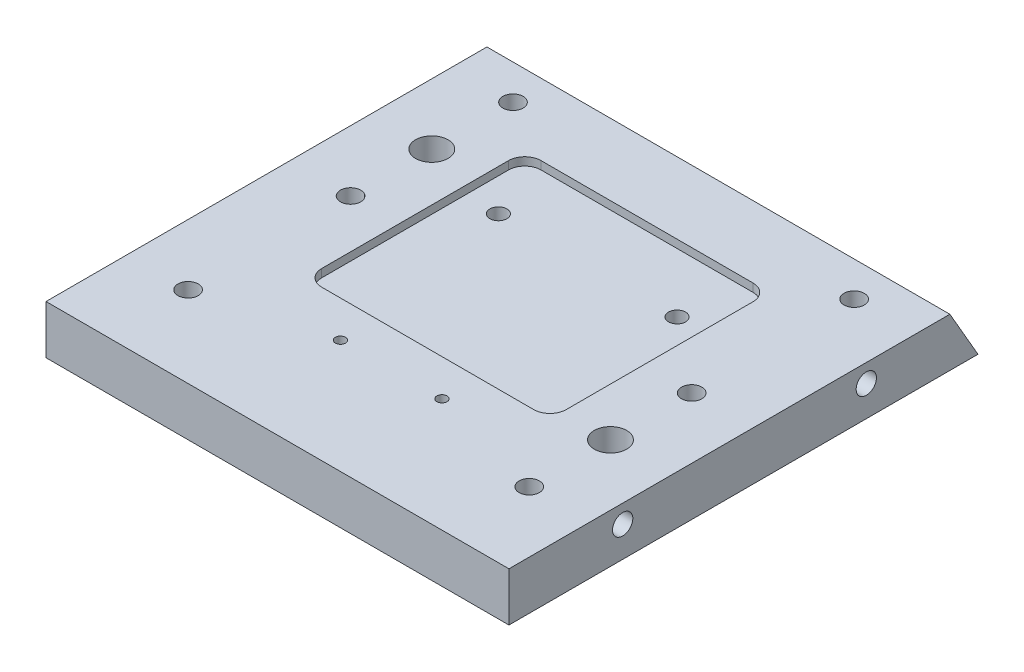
ISO-10303-21;
HEADER;
FILE_DESCRIPTION(('STEP AP214'),'2;1');
FILE_NAME('part.step','',(''),(''),'','','');
FILE_SCHEMA(('AUTOMOTIVE_DESIGN { 1 0 10303 214 1 1 1 1 }'));
ENDSEC;
DATA;
#1=APPLICATION_CONTEXT('core data for automotive mechanical design processes');
#2=APPLICATION_PROTOCOL_DEFINITION('international standard','automotive_design',2000,#1);
#3=PRODUCT_CONTEXT('',#1,'mechanical');
#4=PRODUCT('Part','Part','',(#3));
#5=PRODUCT_RELATED_PRODUCT_CATEGORY('part','',(#4));
#6=PRODUCT_DEFINITION_FORMATION('','',#4);
#7=PRODUCT_DEFINITION_CONTEXT('part definition',#1,'design');
#8=PRODUCT_DEFINITION('design','',#6,#7);
#9=PRODUCT_DEFINITION_SHAPE('','',#8);
#10=(LENGTH_UNIT() NAMED_UNIT(*) SI_UNIT(.MILLI.,.METRE.));
#11=(NAMED_UNIT(*) PLANE_ANGLE_UNIT() SI_UNIT($,.RADIAN.));
#12=(NAMED_UNIT(*) SI_UNIT($,.STERADIAN.) SOLID_ANGLE_UNIT());
#13=UNCERTAINTY_MEASURE_WITH_UNIT(LENGTH_MEASURE(1.E-05),#10,'distance_accuracy_value','');
#14=(GEOMETRIC_REPRESENTATION_CONTEXT(3) GLOBAL_UNCERTAINTY_ASSIGNED_CONTEXT((#13)) GLOBAL_UNIT_ASSIGNED_CONTEXT((#10,
#11,#12)) REPRESENTATION_CONTEXT('',''));
#15=CARTESIAN_POINT('',(0.,0.,0.));
#16=DIRECTION('',(0.,0.,1.));
#17=DIRECTION('',(1.,0.,0.));
#18=AXIS2_PLACEMENT_3D('',#15,#16,#17);
#19=CARTESIAN_POINT('',(57.,12.,0.));
#20=DIRECTION('',(0.,0.,-1.));
#21=DIRECTION('',(0.,1.,0.));
#22=AXIS2_PLACEMENT_3D('',#19,#20,#21);
#23=PLANE('',#22);
#24=DIRECTION('',(0.,-1.,0.));
#25=VECTOR('',#24,1.);
#26=CARTESIAN_POINT('',(-57.,12.,0.));
#27=LINE('',#26,#25);
#28=CARTESIAN_POINT('',(-57.,12.,0.));
#29=VERTEX_POINT('',#28);
#30=CARTESIAN_POINT('',(-57.,0.,0.));
#31=VERTEX_POINT('',#30);
#32=EDGE_CURVE('E269',#29,#31,#27,.T.);
#33=ORIENTED_EDGE('',*,*,#32,.T.);
#34=DIRECTION('',(-1.,0.,0.));
#35=VECTOR('',#34,1.);
#36=CARTESIAN_POINT('',(57.,0.,0.));
#37=LINE('',#36,#35);
#38=CARTESIAN_POINT('',(57.,0.,0.));
#39=VERTEX_POINT('',#38);
#40=EDGE_CURVE('E296',#39,#31,#37,.T.);
#41=ORIENTED_EDGE('',*,*,#40,.F.);
#42=DIRECTION('',(0.,-1.,0.));
#43=VECTOR('',#42,1.);
#44=CARTESIAN_POINT('',(57.,12.,0.));
#45=LINE('',#44,#43);
#46=CARTESIAN_POINT('',(57.,12.,0.));
#47=VERTEX_POINT('',#46);
#48=EDGE_CURVE('E270',#47,#39,#45,.T.);
#49=ORIENTED_EDGE('',*,*,#48,.F.);
#50=DIRECTION('',(-1.,0.,0.));
#51=VECTOR('',#50,1.);
#52=CARTESIAN_POINT('',(57.,12.,0.));
#53=LINE('',#52,#51);
#54=EDGE_CURVE('E280',#47,#29,#53,.T.);
#55=ORIENTED_EDGE('',*,*,#54,.T.);
#56=EDGE_LOOP('',(#33,#41,#49,#55));
#57=FACE_BOUND('',#56,.T.);
#58=ADVANCED_FACE('F37',(#57),#23,.F.);
#59=CARTESIAN_POINT('',(57.,0.,0.));
#60=DIRECTION('',(0.,1.,0.));
#61=DIRECTION('',(0.,0.,1.));
#62=AXIS2_PLACEMENT_3D('',#59,#60,#61);
#63=PLANE('',#62);
#64=CARTESIAN_POINT('',(12.5,0.,-28.));
#65=DIRECTION('',(0.,-1.,0.));
#66=DIRECTION('',(0.,0.,-1.));
#67=AXIS2_PLACEMENT_3D('',#64,#65,#66);
#68=CIRCLE('',#67,1.25);
#69=CARTESIAN_POINT('',(12.5,0.,-29.25));
#70=VERTEX_POINT('',#69);
#71=EDGE_CURVE('E505',#70,#70,#68,.T.);
#72=ORIENTED_EDGE('',*,*,#71,.F.);
#73=EDGE_LOOP('',(#72));
#74=FACE_BOUND('',#73,.T.);
#75=CARTESIAN_POINT('',(-12.5,0.,-28.));
#76=DIRECTION('',(0.,-1.,0.));
#77=DIRECTION('',(0.,0.,-1.));
#78=AXIS2_PLACEMENT_3D('',#75,#76,#77);
#79=CIRCLE('',#78,1.25);
#80=CARTESIAN_POINT('',(-12.5,0.,-29.25));
#81=VERTEX_POINT('',#80);
#82=EDGE_CURVE('E507',#81,#81,#79,.T.);
#83=ORIENTED_EDGE('',*,*,#82,.F.);
#84=EDGE_LOOP('',(#83));
#85=FACE_BOUND('',#84,.T.);
#86=CARTESIAN_POINT('',(-42.,0.,-80.));
#87=DIRECTION('',(0.,-1.,0.));
#88=DIRECTION('',(0.,0.,-1.));
#89=AXIS2_PLACEMENT_3D('',#86,#87,#88);
#90=CIRCLE('',#89,3.99999999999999);
#91=CARTESIAN_POINT('',(-42.,0.,-84.));
#92=VERTEX_POINT('',#91);
#93=EDGE_CURVE('E164',#92,#92,#90,.T.);
#94=ORIENTED_EDGE('',*,*,#93,.F.);
#95=EDGE_LOOP('',(#94));
#96=FACE_BOUND('',#95,.T.);
#97=CARTESIAN_POINT('',(42.,0.,-40.));
#98=DIRECTION('',(0.,-1.,0.));
#99=DIRECTION('',(0.,0.,-1.));
#100=AXIS2_PLACEMENT_3D('',#97,#98,#99);
#101=CIRCLE('',#100,3.99999999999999);
#102=CARTESIAN_POINT('',(42.,0.,-44.));
#103=VERTEX_POINT('',#102);
#104=EDGE_CURVE('E170',#103,#103,#101,.T.);
#105=ORIENTED_EDGE('',*,*,#104,.F.);
#106=EDGE_LOOP('',(#105));
#107=FACE_BOUND('',#106,.T.);
#108=CARTESIAN_POINT('',(-22.,0.,-76.4));
#109=DIRECTION('',(0.,1.,0.));
#110=DIRECTION('',(0.,0.,1.));
#111=AXIS2_PLACEMENT_3D('',#108,#109,#110);
#112=CIRCLE('',#111,2.1);
#113=CARTESIAN_POINT('',(-22.,0.,-74.3));
#114=VERTEX_POINT('',#113);
#115=EDGE_CURVE('E203',#114,#114,#112,.T.);
#116=ORIENTED_EDGE('',*,*,#115,.T.);
#117=EDGE_LOOP('',(#116));
#118=FACE_BOUND('',#117,.T.);
#119=CARTESIAN_POINT('',(22.,0.,-76.4));
#120=DIRECTION('',(0.,1.,0.));
#121=DIRECTION('',(0.,0.,1.));
#122=AXIS2_PLACEMENT_3D('',#119,#120,#121);
#123=CIRCLE('',#122,2.1);
#124=CARTESIAN_POINT('',(22.,0.,-74.3));
#125=VERTEX_POINT('',#124);
#126=EDGE_CURVE('E206',#125,#125,#123,.T.);
#127=ORIENTED_EDGE('',*,*,#126,.T.);
#128=EDGE_LOOP('',(#127));
#129=FACE_BOUND('',#128,.T.);
#130=CARTESIAN_POINT('',(-42.,0.,-20.));
#131=DIRECTION('',(0.,-1.,0.));
#132=DIRECTION('',(0.,0.,-1.));
#133=AXIS2_PLACEMENT_3D('',#130,#131,#132);
#134=CIRCLE('',#133,2.5);
#135=CARTESIAN_POINT('',(-42.,0.,-22.5));
#136=VERTEX_POINT('',#135);
#137=EDGE_CURVE('E233',#136,#136,#134,.T.);
#138=ORIENTED_EDGE('',*,*,#137,.F.);
#139=EDGE_LOOP('',(#138));
#140=FACE_BOUND('',#139,.T.);
#141=CARTESIAN_POINT('',(-42.,0.,-60.));
#142=DIRECTION('',(0.,-1.,0.));
#143=DIRECTION('',(0.,0.,-1.));
#144=AXIS2_PLACEMENT_3D('',#141,#142,#143);
#145=CIRCLE('',#144,2.5);
#146=CARTESIAN_POINT('',(-42.,0.,-62.5));
#147=VERTEX_POINT('',#146);
#148=EDGE_CURVE('E239',#147,#147,#145,.T.);
#149=ORIENTED_EDGE('',*,*,#148,.F.);
#150=EDGE_LOOP('',(#149));
#151=FACE_BOUND('',#150,.T.);
#152=CARTESIAN_POINT('',(-42.,0.,-100.));
#153=DIRECTION('',(0.,-1.,0.));
#154=DIRECTION('',(0.,0.,-1.));
#155=AXIS2_PLACEMENT_3D('',#152,#153,#154);
#156=CIRCLE('',#155,2.5);
#157=CARTESIAN_POINT('',(-42.,0.,-102.5));
#158=VERTEX_POINT('',#157);
#159=EDGE_CURVE('E245',#158,#158,#156,.T.);
#160=ORIENTED_EDGE('',*,*,#159,.F.);
#161=EDGE_LOOP('',(#160));
#162=FACE_BOUND('',#161,.T.);
#163=CARTESIAN_POINT('',(42.,0.,-100.));
#164=DIRECTION('',(0.,-1.,0.));
#165=DIRECTION('',(0.,0.,-1.));
#166=AXIS2_PLACEMENT_3D('',#163,#164,#165);
#167=CIRCLE('',#166,2.5);
#168=CARTESIAN_POINT('',(42.,0.,-102.5));
#169=VERTEX_POINT('',#168);
#170=EDGE_CURVE('E251',#169,#169,#167,.T.);
#171=ORIENTED_EDGE('',*,*,#170,.F.);
#172=EDGE_LOOP('',(#171));
#173=FACE_BOUND('',#172,.T.);
#174=CARTESIAN_POINT('',(42.,0.,-60.));
#175=DIRECTION('',(0.,-1.,0.));
#176=DIRECTION('',(0.,0.,-1.));
#177=AXIS2_PLACEMENT_3D('',#174,#175,#176);
#178=CIRCLE('',#177,2.5);
#179=CARTESIAN_POINT('',(42.,0.,-62.5));
#180=VERTEX_POINT('',#179);
#181=EDGE_CURVE('E257',#180,#180,#178,.T.);
#182=ORIENTED_EDGE('',*,*,#181,.F.);
#183=EDGE_LOOP('',(#182));
#184=FACE_BOUND('',#183,.T.);
#185=CARTESIAN_POINT('',(42.,0.,-20.));
#186=DIRECTION('',(0.,-1.,0.));
#187=DIRECTION('',(0.,0.,-1.));
#188=AXIS2_PLACEMENT_3D('',#185,#186,#187);
#189=CIRCLE('',#188,2.5);
#190=CARTESIAN_POINT('',(42.,0.,-22.5));
#191=VERTEX_POINT('',#190);
#192=EDGE_CURVE('E263',#191,#191,#189,.T.);
#193=ORIENTED_EDGE('',*,*,#192,.F.);
#194=EDGE_LOOP('',(#193));
#195=FACE_BOUND('',#194,.T.);
#196=DIRECTION('',(0.,0.,-1.));
#197=VECTOR('',#196,1.);
#198=CARTESIAN_POINT('',(-57.,0.,0.));
#199=LINE('',#198,#197);
#200=CARTESIAN_POINT('',(-57.,0.,-115.5));
#201=VERTEX_POINT('',#200);
#202=EDGE_CURVE('E283',#31,#201,#199,.T.);
#203=ORIENTED_EDGE('',*,*,#202,.T.);
#204=DIRECTION('',(-1.,0.,0.));
#205=VECTOR('',#204,1.);
#206=CARTESIAN_POINT('',(57.,0.,-115.5));
#207=LINE('',#206,#205);
#208=CARTESIAN_POINT('',(57.,0.,-115.5));
#209=VERTEX_POINT('',#208);
#210=EDGE_CURVE('E293',#209,#201,#207,.T.);
#211=ORIENTED_EDGE('',*,*,#210,.F.);
#212=DIRECTION('',(0.,0.,-1.));
#213=VECTOR('',#212,1.);
#214=CARTESIAN_POINT('',(57.,0.,0.));
#215=LINE('',#214,#213);
#216=EDGE_CURVE('E273',#39,#209,#215,.T.);
#217=ORIENTED_EDGE('',*,*,#216,.F.);
#218=ORIENTED_EDGE('',*,*,#40,.T.);
#219=EDGE_LOOP('',(#203,#211,#217,#218));
#220=FACE_BOUND('',#219,.T.);
#221=ADVANCED_FACE('F375',(#74,#85,#96,#107,#118,#129,#140,#151,#162,#173,#184,#195,#220),#63,.F.);
#222=CARTESIAN_POINT('',(57.,12.,-108.571796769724));
#223=DIRECTION('',(0.,-0.500000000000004,0.866025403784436));
#224=DIRECTION('',(0.,-0.866025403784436,-0.500000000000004));
#225=AXIS2_PLACEMENT_3D('',#222,#223,#224);
#226=PLANE('',#225);
#227=CARTESIAN_POINT('',(47.,5.19615242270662,-112.5));
#228=DIRECTION('',(0.,0.500000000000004,-0.866025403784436));
#229=DIRECTION('',(0.,0.866025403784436,0.500000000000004));
#230=AXIS2_PLACEMENT_3D('',#227,#228,#229);
#231=CIRCLE('',#230,1.24999999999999);
#232=CARTESIAN_POINT('',(47.,6.27868417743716,-111.875));
#233=VERTEX_POINT('',#232);
#234=EDGE_CURVE('E152',#233,#233,#231,.T.);
#235=ORIENTED_EDGE('',*,*,#234,.F.);
#236=EDGE_LOOP('',(#235));
#237=FACE_BOUND('',#236,.T.);
#238=CARTESIAN_POINT('',(-47.,5.19615242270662,-112.5));
#239=DIRECTION('',(0.,0.500000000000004,-0.866025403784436));
#240=DIRECTION('',(0.,0.866025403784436,0.500000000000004));
#241=AXIS2_PLACEMENT_3D('',#238,#239,#240);
#242=CIRCLE('',#241,1.24999999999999);
#243=CARTESIAN_POINT('',(-47.,6.27868417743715,-111.875));
#244=VERTEX_POINT('',#243);
#245=EDGE_CURVE('E151',#244,#244,#242,.T.);
#246=ORIENTED_EDGE('',*,*,#245,.F.);
#247=EDGE_LOOP('',(#246));
#248=FACE_BOUND('',#247,.T.);
#249=DIRECTION('',(0.,0.866025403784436,0.500000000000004));
#250=VECTOR('',#249,1.);
#251=CARTESIAN_POINT('',(-57.,12.,-108.571796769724));
#252=LINE('',#251,#250);
#253=CARTESIAN_POINT('',(-57.,12.,-108.571796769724));
#254=VERTEX_POINT('',#253);
#255=EDGE_CURVE('E285',#201,#254,#252,.T.);
#256=ORIENTED_EDGE('',*,*,#255,.T.);
#257=DIRECTION('',(-1.,0.,0.));
#258=VECTOR('',#257,1.);
#259=CARTESIAN_POINT('',(57.,12.,-108.571796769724));
#260=LINE('',#259,#258);
#261=CARTESIAN_POINT('',(57.,12.,-108.571796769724));
#262=VERTEX_POINT('',#261);
#263=EDGE_CURVE('E290',#262,#254,#260,.T.);
#264=ORIENTED_EDGE('',*,*,#263,.F.);
#265=DIRECTION('',(0.,0.866025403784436,0.500000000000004));
#266=VECTOR('',#265,1.);
#267=CARTESIAN_POINT('',(57.,12.,-108.571796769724));
#268=LINE('',#267,#266);
#269=EDGE_CURVE('E276',#209,#262,#268,.T.);
#270=ORIENTED_EDGE('',*,*,#269,.F.);
#271=ORIENTED_EDGE('',*,*,#210,.T.);
#272=EDGE_LOOP('',(#256,#264,#270,#271));
#273=FACE_BOUND('',#272,.T.);
#274=ADVANCED_FACE('F381',(#237,#248,#273),#226,.F.);
#275=CARTESIAN_POINT('',(57.,12.,-108.571796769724));
#276=DIRECTION('',(0.,-1.,0.));
#277=DIRECTION('',(0.,0.,-1.));
#278=AXIS2_PLACEMENT_3D('',#275,#276,#277);
#279=PLANE('',#278);
#280=CARTESIAN_POINT('',(12.5,12.,-28.));
#281=DIRECTION('',(0.,-1.,0.));
#282=DIRECTION('',(0.,0.,-1.));
#283=AXIS2_PLACEMENT_3D('',#280,#281,#282);
#284=CIRCLE('',#283,1.25);
#285=CARTESIAN_POINT('',(12.5,12.,-29.25));
#286=VERTEX_POINT('',#285);
#287=EDGE_CURVE('E502',#286,#286,#284,.T.);
#288=ORIENTED_EDGE('',*,*,#287,.T.);
#289=EDGE_LOOP('',(#288));
#290=FACE_BOUND('',#289,.T.);
#291=CARTESIAN_POINT('',(-12.5,12.,-28.));
#292=DIRECTION('',(0.,-1.,0.));
#293=DIRECTION('',(0.,0.,-1.));
#294=AXIS2_PLACEMENT_3D('',#291,#292,#293);
#295=CIRCLE('',#294,1.25);
#296=CARTESIAN_POINT('',(-12.5,12.,-29.25));
#297=VERTEX_POINT('',#296);
#298=EDGE_CURVE('E158',#297,#297,#295,.T.);
#299=ORIENTED_EDGE('',*,*,#298,.T.);
#300=EDGE_LOOP('',(#299));
#301=FACE_BOUND('',#300,.T.);
#302=CARTESIAN_POINT('',(-42.,12.,-80.));
#303=DIRECTION('',(0.,-1.,0.));
#304=DIRECTION('',(0.,0.,-1.));
#305=AXIS2_PLACEMENT_3D('',#302,#303,#304);
#306=CIRCLE('',#305,4.);
#307=CARTESIAN_POINT('',(-42.,12.,-84.));
#308=VERTEX_POINT('',#307);
#309=EDGE_CURVE('E167',#308,#308,#306,.T.);
#310=ORIENTED_EDGE('',*,*,#309,.T.);
#311=EDGE_LOOP('',(#310));
#312=FACE_BOUND('',#311,.T.);
#313=CARTESIAN_POINT('',(42.,12.,-40.));
#314=DIRECTION('',(0.,-1.,0.));
#315=DIRECTION('',(0.,0.,-1.));
#316=AXIS2_PLACEMENT_3D('',#313,#314,#315);
#317=CIRCLE('',#316,4.);
#318=CARTESIAN_POINT('',(42.,12.,-44.));
#319=VERTEX_POINT('',#318);
#320=EDGE_CURVE('E173',#319,#319,#317,.T.);
#321=ORIENTED_EDGE('',*,*,#320,.T.);
#322=EDGE_LOOP('',(#321));
#323=FACE_BOUND('',#322,.T.);
#324=DIRECTION('',(1.,0.,0.));
#325=VECTOR('',#324,1.);
#326=CARTESIAN_POINT('',(-30.1,12.,-37.));
#327=LINE('',#326,#325);
#328=CARTESIAN_POINT('',(-26.1,12.,-37.));
#329=VERTEX_POINT('',#328);
#330=CARTESIAN_POINT('',(26.1,12.,-37.));
#331=VERTEX_POINT('',#330);
#332=EDGE_CURVE('E193',#329,#331,#327,.T.);
#333=ORIENTED_EDGE('',*,*,#332,.F.);
#334=CARTESIAN_POINT('',(-26.1,12.,-41.));
#335=DIRECTION('',(0.,-1.,0.));
#336=DIRECTION('',(0.,0.,-1.));
#337=AXIS2_PLACEMENT_3D('',#334,#335,#336);
#338=CIRCLE('',#337,4.);
#339=CARTESIAN_POINT('',(-30.1,12.,-41.));
#340=VERTEX_POINT('',#339);
#341=EDGE_CURVE('E45',#329,#340,#338,.T.);
#342=ORIENTED_EDGE('',*,*,#341,.T.);
#343=DIRECTION('',(0.,0.,1.));
#344=VECTOR('',#343,1.);
#345=CARTESIAN_POINT('',(-30.1,12.,-37.));
#346=LINE('',#345,#344);
#347=CARTESIAN_POINT('',(-30.1,12.,-87.));
#348=VERTEX_POINT('',#347);
#349=EDGE_CURVE('E176',#348,#340,#346,.T.);
#350=ORIENTED_EDGE('',*,*,#349,.F.);
#351=CARTESIAN_POINT('',(-26.1,12.,-87.));
#352=DIRECTION('',(0.,-1.,0.));
#353=DIRECTION('',(0.,0.,-1.));
#354=AXIS2_PLACEMENT_3D('',#351,#352,#353);
#355=CIRCLE('',#354,4.);
#356=CARTESIAN_POINT('',(-26.1,12.,-91.));
#357=VERTEX_POINT('',#356);
#358=EDGE_CURVE('E330',#348,#357,#355,.T.);
#359=ORIENTED_EDGE('',*,*,#358,.T.);
#360=DIRECTION('',(-1.,0.,0.));
#361=VECTOR('',#360,1.);
#362=CARTESIAN_POINT('',(-30.1,12.,-91.));
#363=LINE('',#362,#361);
#364=CARTESIAN_POINT('',(26.1,12.,-91.));
#365=VERTEX_POINT('',#364);
#366=EDGE_CURVE('E181',#365,#357,#363,.T.);
#367=ORIENTED_EDGE('',*,*,#366,.F.);
#368=CARTESIAN_POINT('',(26.1,12.,-87.));
#369=DIRECTION('',(0.,-1.,0.));
#370=DIRECTION('',(0.,0.,-1.));
#371=AXIS2_PLACEMENT_3D('',#368,#369,#370);
#372=CIRCLE('',#371,4.);
#373=CARTESIAN_POINT('',(30.1,12.,-87.));
#374=VERTEX_POINT('',#373);
#375=EDGE_CURVE('E328',#365,#374,#372,.T.);
#376=ORIENTED_EDGE('',*,*,#375,.T.);
#377=DIRECTION('',(0.,0.,-1.));
#378=VECTOR('',#377,1.);
#379=CARTESIAN_POINT('',(30.1,12.,-37.));
#380=LINE('',#379,#378);
#381=CARTESIAN_POINT('',(30.1,12.,-41.));
#382=VERTEX_POINT('',#381);
#383=EDGE_CURVE('E195',#382,#374,#380,.T.);
#384=ORIENTED_EDGE('',*,*,#383,.F.);
#385=CARTESIAN_POINT('',(26.1,12.,-41.));
#386=DIRECTION('',(0.,-1.,0.));
#387=DIRECTION('',(0.,0.,-1.));
#388=AXIS2_PLACEMENT_3D('',#385,#386,#387);
#389=CIRCLE('',#388,4.);
#390=EDGE_CURVE('E11',#382,#331,#389,.T.);
#391=ORIENTED_EDGE('',*,*,#390,.T.);
#392=EDGE_LOOP('',(#333,#342,#350,#359,#367,#376,#384,#391));
#393=FACE_BOUND('',#392,.T.);
#394=CARTESIAN_POINT('',(-42.,12.,-20.));
#395=DIRECTION('',(0.,-1.,0.));
#396=DIRECTION('',(0.,0.,-1.));
#397=AXIS2_PLACEMENT_3D('',#394,#395,#396);
#398=CIRCLE('',#397,2.5);
#399=CARTESIAN_POINT('',(-42.,12.,-22.5));
#400=VERTEX_POINT('',#399);
#401=EDGE_CURVE('E236',#400,#400,#398,.T.);
#402=ORIENTED_EDGE('',*,*,#401,.T.);
#403=EDGE_LOOP('',(#402));
#404=FACE_BOUND('',#403,.T.);
#405=CARTESIAN_POINT('',(-42.,12.,-60.));
#406=DIRECTION('',(0.,-1.,0.));
#407=DIRECTION('',(0.,0.,-1.));
#408=AXIS2_PLACEMENT_3D('',#405,#406,#407);
#409=CIRCLE('',#408,2.5);
#410=CARTESIAN_POINT('',(-42.,12.,-62.5));
#411=VERTEX_POINT('',#410);
#412=EDGE_CURVE('E242',#411,#411,#409,.T.);
#413=ORIENTED_EDGE('',*,*,#412,.T.);
#414=EDGE_LOOP('',(#413));
#415=FACE_BOUND('',#414,.T.);
#416=CARTESIAN_POINT('',(-42.,12.,-100.));
#417=DIRECTION('',(0.,-1.,0.));
#418=DIRECTION('',(0.,0.,-1.));
#419=AXIS2_PLACEMENT_3D('',#416,#417,#418);
#420=CIRCLE('',#419,2.5);
#421=CARTESIAN_POINT('',(-42.,12.,-102.5));
#422=VERTEX_POINT('',#421);
#423=EDGE_CURVE('E248',#422,#422,#420,.T.);
#424=ORIENTED_EDGE('',*,*,#423,.T.);
#425=EDGE_LOOP('',(#424));
#426=FACE_BOUND('',#425,.T.);
#427=CARTESIAN_POINT('',(42.,12.,-100.));
#428=DIRECTION('',(0.,-1.,0.));
#429=DIRECTION('',(0.,0.,-1.));
#430=AXIS2_PLACEMENT_3D('',#427,#428,#429);
#431=CIRCLE('',#430,2.5);
#432=CARTESIAN_POINT('',(42.,12.,-102.5));
#433=VERTEX_POINT('',#432);
#434=EDGE_CURVE('E254',#433,#433,#431,.T.);
#435=ORIENTED_EDGE('',*,*,#434,.T.);
#436=EDGE_LOOP('',(#435));
#437=FACE_BOUND('',#436,.T.);
#438=CARTESIAN_POINT('',(42.,12.,-60.));
#439=DIRECTION('',(0.,-1.,0.));
#440=DIRECTION('',(0.,0.,-1.));
#441=AXIS2_PLACEMENT_3D('',#438,#439,#440);
#442=CIRCLE('',#441,2.5);
#443=CARTESIAN_POINT('',(42.,12.,-62.5));
#444=VERTEX_POINT('',#443);
#445=EDGE_CURVE('E260',#444,#444,#442,.T.);
#446=ORIENTED_EDGE('',*,*,#445,.T.);
#447=EDGE_LOOP('',(#446));
#448=FACE_BOUND('',#447,.T.);
#449=CARTESIAN_POINT('',(42.,12.,-20.));
#450=DIRECTION('',(0.,-1.,0.));
#451=DIRECTION('',(0.,0.,-1.));
#452=AXIS2_PLACEMENT_3D('',#449,#450,#451);
#453=CIRCLE('',#452,2.5);
#454=CARTESIAN_POINT('',(42.,12.,-22.5));
#455=VERTEX_POINT('',#454);
#456=EDGE_CURVE('E266',#455,#455,#453,.T.);
#457=ORIENTED_EDGE('',*,*,#456,.T.);
#458=EDGE_LOOP('',(#457));
#459=FACE_BOUND('',#458,.T.);
#460=DIRECTION('',(0.,0.,1.));
#461=VECTOR('',#460,1.);
#462=CARTESIAN_POINT('',(-57.,12.,-108.571796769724));
#463=LINE('',#462,#461);
#464=EDGE_CURVE('E274',#254,#29,#463,.T.);
#465=ORIENTED_EDGE('',*,*,#464,.T.);
#466=ORIENTED_EDGE('',*,*,#54,.F.);
#467=DIRECTION('',(0.,0.,1.));
#468=VECTOR('',#467,1.);
#469=CARTESIAN_POINT('',(57.,12.,-108.571796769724));
#470=LINE('',#469,#468);
#471=EDGE_CURVE('E278',#262,#47,#470,.T.);
#472=ORIENTED_EDGE('',*,*,#471,.F.);
#473=ORIENTED_EDGE('',*,*,#263,.T.);
#474=EDGE_LOOP('',(#465,#466,#472,#473));
#475=FACE_BOUND('',#474,.T.);
#476=ADVANCED_FACE('F332',(#290,#301,#312,#323,#393,#404,#415,#426,#437,#448,#459,#475),#279,.F.);
#477=CARTESIAN_POINT('',(57.,0.,0.));
#478=DIRECTION('',(1.,0.,0.));
#479=DIRECTION('',(0.,0.,-1.));
#480=AXIS2_PLACEMENT_3D('',#477,#478,#479);
#481=PLANE('',#480);
#482=CARTESIAN_POINT('',(57.,7.50000000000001,-88.));
#483=DIRECTION('',(1.,0.,0.));
#484=DIRECTION('',(0.,0.,-1.));
#485=AXIS2_PLACEMENT_3D('',#482,#483,#484);
#486=CIRCLE('',#485,2.49999999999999);
#487=CARTESIAN_POINT('',(57.,7.50000000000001,-90.5));
#488=VERTEX_POINT('',#487);
#489=EDGE_CURVE('E221',#488,#488,#486,.T.);
#490=ORIENTED_EDGE('',*,*,#489,.F.);
#491=EDGE_LOOP('',(#490));
#492=FACE_BOUND('',#491,.T.);
#493=CARTESIAN_POINT('',(57.,7.50000000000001,-28.));
#494=DIRECTION('',(1.,0.,0.));
#495=DIRECTION('',(0.,0.,-1.));
#496=AXIS2_PLACEMENT_3D('',#493,#494,#495);
#497=CIRCLE('',#496,2.49999999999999);
#498=CARTESIAN_POINT('',(57.,7.50000000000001,-30.5));
#499=VERTEX_POINT('',#498);
#500=EDGE_CURVE('E227',#499,#499,#497,.T.);
#501=ORIENTED_EDGE('',*,*,#500,.F.);
#502=EDGE_LOOP('',(#501));
#503=FACE_BOUND('',#502,.T.);
#504=ORIENTED_EDGE('',*,*,#48,.T.);
#505=ORIENTED_EDGE('',*,*,#216,.T.);
#506=ORIENTED_EDGE('',*,*,#269,.T.);
#507=ORIENTED_EDGE('',*,*,#471,.T.);
#508=EDGE_LOOP('',(#504,#505,#506,#507));
#509=FACE_BOUND('',#508,.T.);
#510=ADVANCED_FACE('F390',(#492,#503,#509),#481,.T.);
#511=CARTESIAN_POINT('',(-57.,0.,0.));
#512=DIRECTION('',(1.,0.,0.));
#513=DIRECTION('',(0.,0.,-1.));
#514=AXIS2_PLACEMENT_3D('',#511,#512,#513);
#515=PLANE('',#514);
#516=CARTESIAN_POINT('',(-57.,7.50000000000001,-88.));
#517=DIRECTION('',(-1.,0.,0.));
#518=DIRECTION('',(0.,0.,1.));
#519=AXIS2_PLACEMENT_3D('',#516,#517,#518);
#520=CIRCLE('',#519,2.49999999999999);
#521=CARTESIAN_POINT('',(-57.,7.50000000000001,-85.5));
#522=VERTEX_POINT('',#521);
#523=EDGE_CURVE('E209',#522,#522,#520,.T.);
#524=ORIENTED_EDGE('',*,*,#523,.F.);
#525=EDGE_LOOP('',(#524));
#526=FACE_BOUND('',#525,.T.);
#527=CARTESIAN_POINT('',(-57.,7.50000000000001,-28.));
#528=DIRECTION('',(-1.,0.,0.));
#529=DIRECTION('',(0.,0.,1.));
#530=AXIS2_PLACEMENT_3D('',#527,#528,#529);
#531=CIRCLE('',#530,2.49999999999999);
#532=CARTESIAN_POINT('',(-57.,7.50000000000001,-25.5));
#533=VERTEX_POINT('',#532);
#534=EDGE_CURVE('E215',#533,#533,#531,.T.);
#535=ORIENTED_EDGE('',*,*,#534,.F.);
#536=EDGE_LOOP('',(#535));
#537=FACE_BOUND('',#536,.T.);
#538=ORIENTED_EDGE('',*,*,#32,.F.);
#539=ORIENTED_EDGE('',*,*,#464,.F.);
#540=ORIENTED_EDGE('',*,*,#255,.F.);
#541=ORIENTED_EDGE('',*,*,#202,.F.);
#542=EDGE_LOOP('',(#538,#539,#540,#541));
#543=FACE_BOUND('',#542,.T.);
#544=ADVANCED_FACE('F392',(#526,#537,#543),#515,.F.);
#545=CARTESIAN_POINT('',(42.,0.,-20.));
#546=DIRECTION('',(0.,-1.,0.));
#547=DIRECTION('',(0.,0.,-1.));
#548=AXIS2_PLACEMENT_3D('',#545,#546,#547);
#549=CYLINDRICAL_SURFACE('',#548,2.5);
#550=ORIENTED_EDGE('',*,*,#456,.F.);
#551=EDGE_LOOP('',(#550));
#552=FACE_BOUND('',#551,.T.);
#553=ORIENTED_EDGE('',*,*,#192,.T.);
#554=EDGE_LOOP('',(#553));
#555=FACE_BOUND('',#554,.T.);
#556=ADVANCED_FACE('F395',(#552,#555),#549,.F.);
#557=CARTESIAN_POINT('',(42.,0.,-60.));
#558=DIRECTION('',(0.,-1.,0.));
#559=DIRECTION('',(0.,0.,-1.));
#560=AXIS2_PLACEMENT_3D('',#557,#558,#559);
#561=CYLINDRICAL_SURFACE('',#560,2.5);
#562=ORIENTED_EDGE('',*,*,#445,.F.);
#563=EDGE_LOOP('',(#562));
#564=FACE_BOUND('',#563,.T.);
#565=ORIENTED_EDGE('',*,*,#181,.T.);
#566=EDGE_LOOP('',(#565));
#567=FACE_BOUND('',#566,.T.);
#568=ADVANCED_FACE('F402',(#564,#567),#561,.F.);
#569=CARTESIAN_POINT('',(42.,0.,-100.));
#570=DIRECTION('',(0.,-1.,0.));
#571=DIRECTION('',(0.,0.,-1.));
#572=AXIS2_PLACEMENT_3D('',#569,#570,#571);
#573=CYLINDRICAL_SURFACE('',#572,2.5);
#574=ORIENTED_EDGE('',*,*,#434,.F.);
#575=EDGE_LOOP('',(#574));
#576=FACE_BOUND('',#575,.T.);
#577=ORIENTED_EDGE('',*,*,#170,.T.);
#578=EDGE_LOOP('',(#577));
#579=FACE_BOUND('',#578,.T.);
#580=ADVANCED_FACE('F406',(#576,#579),#573,.F.);
#581=CARTESIAN_POINT('',(-42.,0.,-100.));
#582=DIRECTION('',(0.,-1.,0.));
#583=DIRECTION('',(0.,0.,-1.));
#584=AXIS2_PLACEMENT_3D('',#581,#582,#583);
#585=CYLINDRICAL_SURFACE('',#584,2.5);
#586=ORIENTED_EDGE('',*,*,#423,.F.);
#587=EDGE_LOOP('',(#586));
#588=FACE_BOUND('',#587,.T.);
#589=ORIENTED_EDGE('',*,*,#159,.T.);
#590=EDGE_LOOP('',(#589));
#591=FACE_BOUND('',#590,.T.);
#592=ADVANCED_FACE('F410',(#588,#591),#585,.F.);
#593=CARTESIAN_POINT('',(-42.,0.,-60.));
#594=DIRECTION('',(0.,-1.,0.));
#595=DIRECTION('',(0.,0.,-1.));
#596=AXIS2_PLACEMENT_3D('',#593,#594,#595);
#597=CYLINDRICAL_SURFACE('',#596,2.5);
#598=ORIENTED_EDGE('',*,*,#412,.F.);
#599=EDGE_LOOP('',(#598));
#600=FACE_BOUND('',#599,.T.);
#601=ORIENTED_EDGE('',*,*,#148,.T.);
#602=EDGE_LOOP('',(#601));
#603=FACE_BOUND('',#602,.T.);
#604=ADVANCED_FACE('F414',(#600,#603),#597,.F.);
#605=CARTESIAN_POINT('',(-42.,0.,-20.));
#606=DIRECTION('',(0.,-1.,0.));
#607=DIRECTION('',(0.,0.,-1.));
#608=AXIS2_PLACEMENT_3D('',#605,#606,#607);
#609=CYLINDRICAL_SURFACE('',#608,2.5);
#610=ORIENTED_EDGE('',*,*,#401,.F.);
#611=EDGE_LOOP('',(#610));
#612=FACE_BOUND('',#611,.T.);
#613=ORIENTED_EDGE('',*,*,#137,.T.);
#614=EDGE_LOOP('',(#613));
#615=FACE_BOUND('',#614,.T.);
#616=ADVANCED_FACE('F418',(#612,#615),#609,.F.);
#617=CARTESIAN_POINT('',(42.,7.50000000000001,-28.));
#618=DIRECTION('',(1.,0.,0.));
#619=DIRECTION('',(0.,0.,-1.));
#620=AXIS2_PLACEMENT_3D('',#617,#618,#619);
#621=CONICAL_SURFACE('',#620,2.5,1.02974425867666);
#622=CARTESIAN_POINT('',(40.4978484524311,7.5,-28.));
#623=VERTEX_POINT('',#622);
#624=VERTEX_LOOP('',#623);
#625=FACE_BOUND('',#624,.T.);
#626=CARTESIAN_POINT('',(42.,7.50000000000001,-28.));
#627=DIRECTION('',(1.,0.,0.));
#628=DIRECTION('',(0.,0.,-1.));
#629=AXIS2_PLACEMENT_3D('',#626,#627,#628);
#630=CIRCLE('',#629,2.5);
#631=CARTESIAN_POINT('',(42.,7.50000000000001,-30.5));
#632=VERTEX_POINT('',#631);
#633=EDGE_CURVE('E230',#632,#632,#630,.T.);
#634=ORIENTED_EDGE('',*,*,#633,.T.);
#635=EDGE_LOOP('',(#634));
#636=FACE_BOUND('',#635,.T.);
#637=ADVANCED_FACE('F422',(#625,#636),#621,.F.);
#638=CARTESIAN_POINT('',(57.,7.50000000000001,-28.));
#639=DIRECTION('',(1.,0.,0.));
#640=DIRECTION('',(0.,0.,-1.));
#641=AXIS2_PLACEMENT_3D('',#638,#639,#640);
#642=CYLINDRICAL_SURFACE('',#641,2.49999999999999);
#643=ORIENTED_EDGE('',*,*,#633,.F.);
#644=EDGE_LOOP('',(#643));
#645=FACE_BOUND('',#644,.T.);
#646=ORIENTED_EDGE('',*,*,#500,.T.);
#647=EDGE_LOOP('',(#646));
#648=FACE_BOUND('',#647,.T.);
#649=ADVANCED_FACE('F426',(#645,#648),#642,.F.);
#650=CARTESIAN_POINT('',(42.,7.50000000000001,-88.));
#651=DIRECTION('',(1.,0.,0.));
#652=DIRECTION('',(0.,0.,-1.));
#653=AXIS2_PLACEMENT_3D('',#650,#651,#652);
#654=CONICAL_SURFACE('',#653,2.5,1.02974425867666);
#655=CARTESIAN_POINT('',(40.4978484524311,7.5,-88.));
#656=VERTEX_POINT('',#655);
#657=VERTEX_LOOP('',#656);
#658=FACE_BOUND('',#657,.T.);
#659=CARTESIAN_POINT('',(42.,7.50000000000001,-88.));
#660=DIRECTION('',(1.,0.,0.));
#661=DIRECTION('',(0.,0.,-1.));
#662=AXIS2_PLACEMENT_3D('',#659,#660,#661);
#663=CIRCLE('',#662,2.5);
#664=CARTESIAN_POINT('',(42.,7.50000000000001,-90.5));
#665=VERTEX_POINT('',#664);
#666=EDGE_CURVE('E224',#665,#665,#663,.T.);
#667=ORIENTED_EDGE('',*,*,#666,.T.);
#668=EDGE_LOOP('',(#667));
#669=FACE_BOUND('',#668,.T.);
#670=ADVANCED_FACE('F430',(#658,#669),#654,.F.);
#671=CARTESIAN_POINT('',(57.,7.50000000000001,-88.));
#672=DIRECTION('',(1.,0.,0.));
#673=DIRECTION('',(0.,0.,-1.));
#674=AXIS2_PLACEMENT_3D('',#671,#672,#673);
#675=CYLINDRICAL_SURFACE('',#674,2.49999999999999);
#676=ORIENTED_EDGE('',*,*,#666,.F.);
#677=EDGE_LOOP('',(#676));
#678=FACE_BOUND('',#677,.T.);
#679=ORIENTED_EDGE('',*,*,#489,.T.);
#680=EDGE_LOOP('',(#679));
#681=FACE_BOUND('',#680,.T.);
#682=ADVANCED_FACE('F434',(#678,#681),#675,.F.);
#683=CARTESIAN_POINT('',(-42.,7.50000000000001,-28.));
#684=DIRECTION('',(-1.,0.,0.));
#685=DIRECTION('',(0.,0.,1.));
#686=AXIS2_PLACEMENT_3D('',#683,#684,#685);
#687=CONICAL_SURFACE('',#686,2.49999999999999,1.02974425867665);
#688=CARTESIAN_POINT('',(-40.4978484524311,7.5,-28.));
#689=VERTEX_POINT('',#688);
#690=VERTEX_LOOP('',#689);
#691=FACE_BOUND('',#690,.T.);
#692=CARTESIAN_POINT('',(-42.,7.50000000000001,-28.));
#693=DIRECTION('',(-1.,0.,0.));
#694=DIRECTION('',(0.,0.,1.));
#695=AXIS2_PLACEMENT_3D('',#692,#693,#694);
#696=CIRCLE('',#695,2.49999999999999);
#697=CARTESIAN_POINT('',(-42.,7.50000000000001,-25.5));
#698=VERTEX_POINT('',#697);
#699=EDGE_CURVE('E218',#698,#698,#696,.T.);
#700=ORIENTED_EDGE('',*,*,#699,.T.);
#701=EDGE_LOOP('',(#700));
#702=FACE_BOUND('',#701,.T.);
#703=ADVANCED_FACE('F438',(#691,#702),#687,.F.);
#704=CARTESIAN_POINT('',(-57.,7.50000000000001,-28.));
#705=DIRECTION('',(-1.,0.,0.));
#706=DIRECTION('',(0.,0.,1.));
#707=AXIS2_PLACEMENT_3D('',#704,#705,#706);
#708=CYLINDRICAL_SURFACE('',#707,2.49999999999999);
#709=ORIENTED_EDGE('',*,*,#699,.F.);
#710=EDGE_LOOP('',(#709));
#711=FACE_BOUND('',#710,.T.);
#712=ORIENTED_EDGE('',*,*,#534,.T.);
#713=EDGE_LOOP('',(#712));
#714=FACE_BOUND('',#713,.T.);
#715=ADVANCED_FACE('F442',(#711,#714),#708,.F.);
#716=CARTESIAN_POINT('',(-42.,7.50000000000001,-88.));
#717=DIRECTION('',(-1.,0.,0.));
#718=DIRECTION('',(0.,0.,1.));
#719=AXIS2_PLACEMENT_3D('',#716,#717,#718);
#720=CONICAL_SURFACE('',#719,2.49999999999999,1.02974425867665);
#721=CARTESIAN_POINT('',(-40.4978484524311,7.5,-88.));
#722=VERTEX_POINT('',#721);
#723=VERTEX_LOOP('',#722);
#724=FACE_BOUND('',#723,.T.);
#725=CARTESIAN_POINT('',(-42.,7.50000000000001,-88.));
#726=DIRECTION('',(-1.,0.,0.));
#727=DIRECTION('',(0.,0.,1.));
#728=AXIS2_PLACEMENT_3D('',#725,#726,#727);
#729=CIRCLE('',#728,2.49999999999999);
#730=CARTESIAN_POINT('',(-42.,7.50000000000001,-85.5));
#731=VERTEX_POINT('',#730);
#732=EDGE_CURVE('E212',#731,#731,#729,.T.);
#733=ORIENTED_EDGE('',*,*,#732,.T.);
#734=EDGE_LOOP('',(#733));
#735=FACE_BOUND('',#734,.T.);
#736=ADVANCED_FACE('F446',(#724,#735),#720,.F.);
#737=CARTESIAN_POINT('',(-57.,7.50000000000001,-88.));
#738=DIRECTION('',(-1.,0.,0.));
#739=DIRECTION('',(0.,0.,1.));
#740=AXIS2_PLACEMENT_3D('',#737,#738,#739);
#741=CYLINDRICAL_SURFACE('',#740,2.49999999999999);
#742=ORIENTED_EDGE('',*,*,#732,.F.);
#743=EDGE_LOOP('',(#742));
#744=FACE_BOUND('',#743,.T.);
#745=ORIENTED_EDGE('',*,*,#523,.T.);
#746=EDGE_LOOP('',(#745));
#747=FACE_BOUND('',#746,.T.);
#748=ADVANCED_FACE('F450',(#744,#747),#741,.F.);
#749=CARTESIAN_POINT('',(22.,12.,-76.4));
#750=DIRECTION('',(0.,1.,0.));
#751=DIRECTION('',(0.,0.,1.));
#752=AXIS2_PLACEMENT_3D('',#749,#750,#751);
#753=CYLINDRICAL_SURFACE('',#752,2.1);
#754=CARTESIAN_POINT('',(22.,10.,-76.4));
#755=DIRECTION('',(0.,-1.,0.));
#756=DIRECTION('',(0.,0.,-1.));
#757=AXIS2_PLACEMENT_3D('',#754,#755,#756);
#758=CIRCLE('',#757,2.1);
#759=CARTESIAN_POINT('',(22.,10.,-78.5));
#760=VERTEX_POINT('',#759);
#761=EDGE_CURVE('E200',#760,#760,#758,.F.);
#762=ORIENTED_EDGE('',*,*,#761,.T.);
#763=EDGE_LOOP('',(#762));
#764=FACE_BOUND('',#763,.T.);
#765=ORIENTED_EDGE('',*,*,#126,.F.);
#766=EDGE_LOOP('',(#765));
#767=FACE_BOUND('',#766,.T.);
#768=ADVANCED_FACE('F454',(#764,#767),#753,.F.);
#769=CARTESIAN_POINT('',(-22.,12.,-76.4));
#770=DIRECTION('',(0.,1.,0.));
#771=DIRECTION('',(0.,0.,1.));
#772=AXIS2_PLACEMENT_3D('',#769,#770,#771);
#773=CYLINDRICAL_SURFACE('',#772,2.1);
#774=CARTESIAN_POINT('',(-22.,10.,-76.4));
#775=DIRECTION('',(0.,-1.,0.));
#776=DIRECTION('',(0.,0.,-1.));
#777=AXIS2_PLACEMENT_3D('',#774,#775,#776);
#778=CIRCLE('',#777,2.1);
#779=CARTESIAN_POINT('',(-22.,10.,-78.5));
#780=VERTEX_POINT('',#779);
#781=EDGE_CURVE('E190',#780,#780,#778,.F.);
#782=ORIENTED_EDGE('',*,*,#781,.T.);
#783=EDGE_LOOP('',(#782));
#784=FACE_BOUND('',#783,.T.);
#785=ORIENTED_EDGE('',*,*,#115,.F.);
#786=EDGE_LOOP('',(#785));
#787=FACE_BOUND('',#786,.T.);
#788=ADVANCED_FACE('F458',(#784,#787),#773,.F.);
#789=CARTESIAN_POINT('',(0.,10.,0.));
#790=DIRECTION('',(0.,-1.,0.));
#791=DIRECTION('',(0.,0.,-1.));
#792=AXIS2_PLACEMENT_3D('',#789,#790,#791);
#793=PLANE('',#792);
#794=ORIENTED_EDGE('',*,*,#781,.F.);
#795=EDGE_LOOP('',(#794));
#796=FACE_BOUND('',#795,.T.);
#797=DIRECTION('',(0.,0.,-1.));
#798=VECTOR('',#797,1.);
#799=CARTESIAN_POINT('',(30.1,10.,-37.));
#800=LINE('',#799,#798);
#801=CARTESIAN_POINT('',(30.1,10.,-41.));
#802=VERTEX_POINT('',#801);
#803=CARTESIAN_POINT('',(30.1,10.,-87.));
#804=VERTEX_POINT('',#803);
#805=EDGE_CURVE('E184',#802,#804,#800,.T.);
#806=ORIENTED_EDGE('',*,*,#805,.T.);
#807=CARTESIAN_POINT('',(26.1,10.,-87.));
#808=DIRECTION('',(0.,-1.,0.));
#809=DIRECTION('',(0.,0.,-1.));
#810=AXIS2_PLACEMENT_3D('',#807,#808,#809);
#811=CIRCLE('',#810,4.);
#812=CARTESIAN_POINT('',(26.1,10.,-91.));
#813=VERTEX_POINT('',#812);
#814=EDGE_CURVE('E317',#804,#813,#811,.F.);
#815=ORIENTED_EDGE('',*,*,#814,.T.);
#816=DIRECTION('',(-1.,0.,0.));
#817=VECTOR('',#816,1.);
#818=CARTESIAN_POINT('',(-30.1,10.,-91.));
#819=LINE('',#818,#817);
#820=CARTESIAN_POINT('',(-26.1,10.,-91.));
#821=VERTEX_POINT('',#820);
#822=EDGE_CURVE('E187',#813,#821,#819,.T.);
#823=ORIENTED_EDGE('',*,*,#822,.T.);
#824=CARTESIAN_POINT('',(-26.1,10.,-87.));
#825=DIRECTION('',(0.,-1.,0.));
#826=DIRECTION('',(0.,0.,-1.));
#827=AXIS2_PLACEMENT_3D('',#824,#825,#826);
#828=CIRCLE('',#827,4.);
#829=CARTESIAN_POINT('',(-30.1,10.,-87.));
#830=VERTEX_POINT('',#829);
#831=EDGE_CURVE('E315',#821,#830,#828,.F.);
#832=ORIENTED_EDGE('',*,*,#831,.T.);
#833=DIRECTION('',(0.,0.,1.));
#834=VECTOR('',#833,1.);
#835=CARTESIAN_POINT('',(-30.1,10.,-37.));
#836=LINE('',#835,#834);
#837=CARTESIAN_POINT('',(-30.1,10.,-41.));
#838=VERTEX_POINT('',#837);
#839=EDGE_CURVE('E177',#830,#838,#836,.T.);
#840=ORIENTED_EDGE('',*,*,#839,.T.);
#841=CARTESIAN_POINT('',(-26.1,10.,-41.));
#842=DIRECTION('',(0.,-1.,0.));
#843=DIRECTION('',(0.,0.,-1.));
#844=AXIS2_PLACEMENT_3D('',#841,#842,#843);
#845=CIRCLE('',#844,4.);
#846=CARTESIAN_POINT('',(-26.1,10.,-37.));
#847=VERTEX_POINT('',#846);
#848=EDGE_CURVE('E313',#838,#847,#845,.F.);
#849=ORIENTED_EDGE('',*,*,#848,.T.);
#850=DIRECTION('',(1.,0.,0.));
#851=VECTOR('',#850,1.);
#852=CARTESIAN_POINT('',(-30.1,10.,-37.));
#853=LINE('',#852,#851);
#854=CARTESIAN_POINT('',(26.1,10.,-37.));
#855=VERTEX_POINT('',#854);
#856=EDGE_CURVE('E180',#847,#855,#853,.T.);
#857=ORIENTED_EDGE('',*,*,#856,.T.);
#858=CARTESIAN_POINT('',(26.1,10.,-41.));
#859=DIRECTION('',(0.,-1.,0.));
#860=DIRECTION('',(0.,0.,-1.));
#861=AXIS2_PLACEMENT_3D('',#858,#859,#860);
#862=CIRCLE('',#861,4.);
#863=EDGE_CURVE('E311',#855,#802,#862,.F.);
#864=ORIENTED_EDGE('',*,*,#863,.T.);
#865=EDGE_LOOP('',(#806,#815,#823,#832,#840,#849,#857,#864));
#866=FACE_BOUND('',#865,.T.);
#867=ORIENTED_EDGE('',*,*,#761,.F.);
#868=EDGE_LOOP('',(#867));
#869=FACE_BOUND('',#868,.T.);
#870=ADVANCED_FACE('F342',(#796,#866,#869),#793,.F.);
#871=CARTESIAN_POINT('',(-30.1,10.,-37.));
#872=DIRECTION('',(-1.,0.,0.));
#873=DIRECTION('',(0.,0.,1.));
#874=AXIS2_PLACEMENT_3D('',#871,#872,#873);
#875=PLANE('',#874);
#876=ORIENTED_EDGE('',*,*,#839,.F.);
#877=DIRECTION('',(0.,1.,0.));
#878=VECTOR('',#877,1.);
#879=CARTESIAN_POINT('',(-30.1,12.,-87.));
#880=LINE('',#879,#878);
#881=EDGE_CURVE('E321',#830,#348,#880,.T.);
#882=ORIENTED_EDGE('',*,*,#881,.T.);
#883=ORIENTED_EDGE('',*,*,#349,.T.);
#884=DIRECTION('',(0.,1.,0.));
#885=VECTOR('',#884,1.);
#886=CARTESIAN_POINT('',(-30.1,10.,-41.));
#887=LINE('',#886,#885);
#888=EDGE_CURVE('E319',#340,#838,#887,.F.);
#889=ORIENTED_EDGE('',*,*,#888,.T.);
#890=EDGE_LOOP('',(#876,#882,#883,#889));
#891=FACE_BOUND('',#890,.T.);
#892=ADVANCED_FACE('F336',(#891),#875,.F.);
#893=CARTESIAN_POINT('',(-30.1,10.,-91.));
#894=DIRECTION('',(0.,0.,-1.));
#895=DIRECTION('',(0.,1.,0.));
#896=AXIS2_PLACEMENT_3D('',#893,#894,#895);
#897=PLANE('',#896);
#898=ORIENTED_EDGE('',*,*,#822,.F.);
#899=DIRECTION('',(0.,1.,0.));
#900=VECTOR('',#899,1.);
#901=CARTESIAN_POINT('',(26.1,12.,-91.));
#902=LINE('',#901,#900);
#903=EDGE_CURVE('E303',#813,#365,#902,.T.);
#904=ORIENTED_EDGE('',*,*,#903,.T.);
#905=ORIENTED_EDGE('',*,*,#366,.T.);
#906=DIRECTION('',(0.,1.,0.));
#907=VECTOR('',#906,1.);
#908=CARTESIAN_POINT('',(-26.1,10.,-91.));
#909=LINE('',#908,#907);
#910=EDGE_CURVE('E299',#357,#821,#909,.F.);
#911=ORIENTED_EDGE('',*,*,#910,.T.);
#912=EDGE_LOOP('',(#898,#904,#905,#911));
#913=FACE_BOUND('',#912,.T.);
#914=ADVANCED_FACE('F361',(#913),#897,.F.);
#915=CARTESIAN_POINT('',(30.1,10.,-37.));
#916=DIRECTION('',(1.,0.,0.));
#917=DIRECTION('',(0.,0.,-1.));
#918=AXIS2_PLACEMENT_3D('',#915,#916,#917);
#919=PLANE('',#918);
#920=ORIENTED_EDGE('',*,*,#383,.T.);
#921=DIRECTION('',(0.,1.,0.));
#922=VECTOR('',#921,1.);
#923=CARTESIAN_POINT('',(30.1,10.,-87.));
#924=LINE('',#923,#922);
#925=EDGE_CURVE('E309',#374,#804,#924,.F.);
#926=ORIENTED_EDGE('',*,*,#925,.T.);
#927=ORIENTED_EDGE('',*,*,#805,.F.);
#928=DIRECTION('',(0.,1.,0.));
#929=VECTOR('',#928,1.);
#930=CARTESIAN_POINT('',(30.1,12.,-41.));
#931=LINE('',#930,#929);
#932=EDGE_CURVE('E306',#802,#382,#931,.T.);
#933=ORIENTED_EDGE('',*,*,#932,.T.);
#934=EDGE_LOOP('',(#920,#926,#927,#933));
#935=FACE_BOUND('',#934,.T.);
#936=ADVANCED_FACE('F353',(#935),#919,.F.);
#937=CARTESIAN_POINT('',(-30.1,10.,-37.));
#938=DIRECTION('',(0.,0.,1.));
#939=DIRECTION('',(0.,-1.,0.));
#940=AXIS2_PLACEMENT_3D('',#937,#938,#939);
#941=PLANE('',#940);
#942=ORIENTED_EDGE('',*,*,#856,.F.);
#943=DIRECTION('',(0.,1.,0.));
#944=VECTOR('',#943,1.);
#945=CARTESIAN_POINT('',(-26.1,12.,-37.));
#946=LINE('',#945,#944);
#947=EDGE_CURVE('E326',#847,#329,#946,.T.);
#948=ORIENTED_EDGE('',*,*,#947,.T.);
#949=ORIENTED_EDGE('',*,*,#332,.T.);
#950=DIRECTION('',(0.,1.,0.));
#951=VECTOR('',#950,1.);
#952=CARTESIAN_POINT('',(26.1,10.,-37.));
#953=LINE('',#952,#951);
#954=EDGE_CURVE('E324',#331,#855,#953,.F.);
#955=ORIENTED_EDGE('',*,*,#954,.T.);
#956=EDGE_LOOP('',(#942,#948,#949,#955));
#957=FACE_BOUND('',#956,.T.);
#958=ADVANCED_FACE('F346',(#957),#941,.F.);
#959=CARTESIAN_POINT('',(42.,0.,-40.));
#960=DIRECTION('',(0.,-1.,0.));
#961=DIRECTION('',(0.,0.,-1.));
#962=AXIS2_PLACEMENT_3D('',#959,#960,#961);
#963=CYLINDRICAL_SURFACE('',#962,3.99999999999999);
#964=ORIENTED_EDGE('',*,*,#320,.F.);
#965=EDGE_LOOP('',(#964));
#966=FACE_BOUND('',#965,.T.);
#967=ORIENTED_EDGE('',*,*,#104,.T.);
#968=EDGE_LOOP('',(#967));
#969=FACE_BOUND('',#968,.T.);
#970=ADVANCED_FACE('F467',(#966,#969),#963,.F.);
#971=CARTESIAN_POINT('',(-42.,0.,-80.));
#972=DIRECTION('',(0.,-1.,0.));
#973=DIRECTION('',(0.,0.,-1.));
#974=AXIS2_PLACEMENT_3D('',#971,#972,#973);
#975=CYLINDRICAL_SURFACE('',#974,3.99999999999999);
#976=ORIENTED_EDGE('',*,*,#309,.F.);
#977=EDGE_LOOP('',(#976));
#978=FACE_BOUND('',#977,.T.);
#979=ORIENTED_EDGE('',*,*,#93,.T.);
#980=EDGE_LOOP('',(#979));
#981=FACE_BOUND('',#980,.T.);
#982=ADVANCED_FACE('F372',(#978,#981),#975,.F.);
#983=CARTESIAN_POINT('',(26.1,10.,-87.));
#984=DIRECTION('',(0.,-1.,0.));
#985=DIRECTION('',(0.,0.,-1.));
#986=AXIS2_PLACEMENT_3D('',#983,#984,#985);
#987=CYLINDRICAL_SURFACE('',#986,4.);
#988=ORIENTED_EDGE('',*,*,#814,.F.);
#989=ORIENTED_EDGE('',*,*,#925,.F.);
#990=ORIENTED_EDGE('',*,*,#375,.F.);
#991=ORIENTED_EDGE('',*,*,#903,.F.);
#992=EDGE_LOOP('',(#988,#989,#990,#991));
#993=FACE_BOUND('',#992,.T.);
#994=ADVANCED_FACE('F356',(#993),#987,.F.);
#995=CARTESIAN_POINT('',(-26.1,10.,-87.));
#996=DIRECTION('',(0.,-1.,0.));
#997=DIRECTION('',(0.,0.,-1.));
#998=AXIS2_PLACEMENT_3D('',#995,#996,#997);
#999=CYLINDRICAL_SURFACE('',#998,4.);
#1000=ORIENTED_EDGE('',*,*,#831,.F.);
#1001=ORIENTED_EDGE('',*,*,#910,.F.);
#1002=ORIENTED_EDGE('',*,*,#358,.F.);
#1003=ORIENTED_EDGE('',*,*,#881,.F.);
#1004=EDGE_LOOP('',(#1000,#1001,#1002,#1003));
#1005=FACE_BOUND('',#1004,.T.);
#1006=ADVANCED_FACE('F365',(#1005),#999,.F.);
#1007=CARTESIAN_POINT('',(-26.1,10.,-41.));
#1008=DIRECTION('',(0.,-1.,0.));
#1009=DIRECTION('',(0.,0.,-1.));
#1010=AXIS2_PLACEMENT_3D('',#1007,#1008,#1009);
#1011=CYLINDRICAL_SURFACE('',#1010,4.);
#1012=ORIENTED_EDGE('',*,*,#848,.F.);
#1013=ORIENTED_EDGE('',*,*,#888,.F.);
#1014=ORIENTED_EDGE('',*,*,#341,.F.);
#1015=ORIENTED_EDGE('',*,*,#947,.F.);
#1016=EDGE_LOOP('',(#1012,#1013,#1014,#1015));
#1017=FACE_BOUND('',#1016,.T.);
#1018=ADVANCED_FACE('F339',(#1017),#1011,.F.);
#1019=CARTESIAN_POINT('',(26.1,10.,-41.));
#1020=DIRECTION('',(0.,-1.,0.));
#1021=DIRECTION('',(0.,0.,-1.));
#1022=AXIS2_PLACEMENT_3D('',#1019,#1020,#1021);
#1023=CYLINDRICAL_SURFACE('',#1022,4.);
#1024=ORIENTED_EDGE('',*,*,#863,.F.);
#1025=ORIENTED_EDGE('',*,*,#954,.F.);
#1026=ORIENTED_EDGE('',*,*,#390,.F.);
#1027=ORIENTED_EDGE('',*,*,#932,.F.);
#1028=EDGE_LOOP('',(#1024,#1025,#1026,#1027));
#1029=FACE_BOUND('',#1028,.T.);
#1030=ADVANCED_FACE('F39',(#1029),#1023,.F.);
#1031=CARTESIAN_POINT('',(-47.,1.44615242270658,-106.004809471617));
#1032=DIRECTION('',(0.,0.500000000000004,-0.866025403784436));
#1033=DIRECTION('',(0.,0.866025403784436,0.500000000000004));
#1034=AXIS2_PLACEMENT_3D('',#1031,#1032,#1033);
#1035=CONICAL_SURFACE('',#1034,1.24999999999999,1.02974425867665);
#1036=CARTESIAN_POINT('',(-47.,1.07061453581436,-105.354358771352));
#1037=VERTEX_POINT('',#1036);
#1038=VERTEX_LOOP('',#1037);
#1039=FACE_BOUND('',#1038,.T.);
#1040=CARTESIAN_POINT('',(-47.,1.44615242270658,-106.004809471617));
#1041=DIRECTION('',(0.,0.500000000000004,-0.866025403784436));
#1042=DIRECTION('',(0.,0.866025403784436,0.500000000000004));
#1043=AXIS2_PLACEMENT_3D('',#1040,#1041,#1042);
#1044=CIRCLE('',#1043,1.24999999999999);
#1045=CARTESIAN_POINT('',(-47.,2.52868417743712,-105.379809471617));
#1046=VERTEX_POINT('',#1045);
#1047=EDGE_CURVE('E155',#1046,#1046,#1044,.T.);
#1048=ORIENTED_EDGE('',*,*,#1047,.T.);
#1049=EDGE_LOOP('',(#1048));
#1050=FACE_BOUND('',#1049,.T.);
#1051=ADVANCED_FACE('F481',(#1039,#1050),#1035,.F.);
#1052=CARTESIAN_POINT('',(-47.,5.19615242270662,-112.5));
#1053=DIRECTION('',(0.,0.500000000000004,-0.866025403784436));
#1054=DIRECTION('',(0.,0.866025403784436,0.500000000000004));
#1055=AXIS2_PLACEMENT_3D('',#1052,#1053,#1054);
#1056=CYLINDRICAL_SURFACE('',#1055,1.24999999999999);
#1057=CARTESIAN_POINT('',(-47.,2.52868417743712,-105.379809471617));
#1058=CARTESIAN_POINT('',(-47.,2.56774667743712,-105.447467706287));
#1059=CARTESIAN_POINT('',(-47.,2.60680917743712,-105.515125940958));
#1060=CARTESIAN_POINT('',(-47.,2.68493417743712,-105.650442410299));
#1061=CARTESIAN_POINT('',(-47.,2.72399667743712,-105.71810064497));
#1062=CARTESIAN_POINT('',(-47.,2.80212167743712,-105.853417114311));
#1063=CARTESIAN_POINT('',(-47.,2.84118417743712,-105.921075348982));
#1064=CARTESIAN_POINT('',(-47.,2.91930917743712,-106.056391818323));
#1065=CARTESIAN_POINT('',(-47.,2.95837167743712,-106.124050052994));
#1066=CARTESIAN_POINT('',(-47.,3.03649667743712,-106.259366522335));
#1067=CARTESIAN_POINT('',(-47.,3.07555917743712,-106.327024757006));
#1068=CARTESIAN_POINT('',(-47.,3.15368417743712,-106.462341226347));
#1069=CARTESIAN_POINT('',(-47.,3.19274667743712,-106.529999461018));
#1070=CARTESIAN_POINT('',(-47.,3.27087167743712,-106.665315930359));
#1071=CARTESIAN_POINT('',(-47.,3.30993417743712,-106.73297416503));
#1072=CARTESIAN_POINT('',(-47.,3.38805917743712,-106.868290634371));
#1073=CARTESIAN_POINT('',(-47.,3.42712167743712,-106.935948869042));
#1074=CARTESIAN_POINT('',(-47.,3.50524667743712,-107.071265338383));
#1075=CARTESIAN_POINT('',(-47.,3.54430917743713,-107.138923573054));
#1076=CARTESIAN_POINT('',(-47.,3.62243417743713,-107.274240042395));
#1077=CARTESIAN_POINT('',(-47.,3.66149667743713,-107.341898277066));
#1078=CARTESIAN_POINT('',(-47.,3.73962167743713,-107.477214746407));
#1079=CARTESIAN_POINT('',(-47.,3.77868417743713,-107.544872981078));
#1080=CARTESIAN_POINT('',(-47.,3.85680917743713,-107.680189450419));
#1081=CARTESIAN_POINT('',(-47.,3.89587167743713,-107.74784768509));
#1082=CARTESIAN_POINT('',(-47.,3.97399667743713,-107.883164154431));
#1083=CARTESIAN_POINT('',(-47.,4.01305917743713,-107.950822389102));
#1084=CARTESIAN_POINT('',(-47.,4.09118417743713,-108.086138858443));
#1085=CARTESIAN_POINT('',(-47.,4.13024667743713,-108.153797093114));
#1086=CARTESIAN_POINT('',(-47.,4.20837167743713,-108.289113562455));
#1087=CARTESIAN_POINT('',(-47.,4.24743417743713,-108.356771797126));
#1088=CARTESIAN_POINT('',(-47.,4.32555917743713,-108.492088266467));
#1089=CARTESIAN_POINT('',(-47.,4.36462167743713,-108.559746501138));
#1090=CARTESIAN_POINT('',(-47.,4.44274667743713,-108.695062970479));
#1091=CARTESIAN_POINT('',(-47.,4.48180917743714,-108.76272120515));
#1092=CARTESIAN_POINT('',(-47.,4.55993417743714,-108.898037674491));
#1093=CARTESIAN_POINT('',(-47.,4.59899667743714,-108.965695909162));
#1094=CARTESIAN_POINT('',(-47.,4.67712167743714,-109.101012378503));
#1095=CARTESIAN_POINT('',(-47.,4.71618417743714,-109.168670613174));
#1096=CARTESIAN_POINT('',(-47.,4.79430917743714,-109.303987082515));
#1097=CARTESIAN_POINT('',(-47.,4.83337167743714,-109.371645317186));
#1098=CARTESIAN_POINT('',(-47.,4.91149667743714,-109.506961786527));
#1099=CARTESIAN_POINT('',(-47.,4.95055917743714,-109.574620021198));
#1100=CARTESIAN_POINT('',(-47.,5.02868417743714,-109.709936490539));
#1101=CARTESIAN_POINT('',(-47.,5.06774667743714,-109.77759472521));
#1102=CARTESIAN_POINT('',(-47.,5.14587167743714,-109.912911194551));
#1103=CARTESIAN_POINT('',(-47.,5.18493417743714,-109.980569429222));
#1104=CARTESIAN_POINT('',(-47.,5.26305917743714,-110.115885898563));
#1105=CARTESIAN_POINT('',(-47.,5.30212167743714,-110.183544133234));
#1106=CARTESIAN_POINT('',(-47.,5.38024667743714,-110.318860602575));
#1107=CARTESIAN_POINT('',(-47.,5.41930917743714,-110.386518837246));
#1108=CARTESIAN_POINT('',(-47.,5.49743417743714,-110.521835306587));
#1109=CARTESIAN_POINT('',(-47.,5.53649667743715,-110.589493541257));
#1110=CARTESIAN_POINT('',(-47.,5.61462167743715,-110.724810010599));
#1111=CARTESIAN_POINT('',(-47.,5.65368417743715,-110.792468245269));
#1112=CARTESIAN_POINT('',(-47.,5.73180917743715,-110.927784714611));
#1113=CARTESIAN_POINT('',(-47.,5.77087167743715,-110.995442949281));
#1114=CARTESIAN_POINT('',(-47.,5.84899667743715,-111.130759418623));
#1115=CARTESIAN_POINT('',(-47.,5.88805917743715,-111.198417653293));
#1116=CARTESIAN_POINT('',(-47.,5.96618417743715,-111.333734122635));
#1117=CARTESIAN_POINT('',(-47.,6.00524667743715,-111.401392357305));
#1118=CARTESIAN_POINT('',(-47.,6.08337167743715,-111.536708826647));
#1119=CARTESIAN_POINT('',(-47.,6.12243417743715,-111.604367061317));
#1120=CARTESIAN_POINT('',(-47.,6.20055917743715,-111.739683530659));
#1121=CARTESIAN_POINT('',(-47.,6.23962167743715,-111.807341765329));
#1122=CARTESIAN_POINT('',(-47.,6.27868417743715,-111.875));
#1123=B_SPLINE_CURVE_WITH_KNOTS('',3,(#1057,#1058,#1059,#1060,#1061,#1062,#1063,#1064,#1065,
#1066,#1067,#1068,#1069,#1070,#1071,#1072,#1073,#1074,#1075,#1076,#1077,#1078,#1079,#1080,#1081,
#1082,#1083,#1084,#1085,#1086,#1087,#1088,#1089,#1090,#1091,#1092,#1093,#1094,#1095,#1096,#1097,
#1098,#1099,#1100,#1101,#1102,#1103,#1104,#1105,#1106,#1107,#1108,#1109,#1110,#1111,#1112,#1113,
#1114,#1115,#1116,#1117,#1118,#1119,#1120,#1121,#1122),.UNSPECIFIED.,.F.,.F.,(4,2,2,2,2,2,2,2,2,
2,2,2,2,2,2,2,2,2,2,2,2,2,2,2,2,2,2,2,2,2,2,2,4),(0.,0.234375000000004,0.468750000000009,
0.703125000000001,0.937500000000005,1.17187500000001,1.40625,1.64062500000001,1.87500000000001,
2.109375,2.34375000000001,2.57812500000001,2.8125,3.04687500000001,3.28125000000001,
3.51562500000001,3.75000000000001,3.984375,4.21875000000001,4.45312500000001,4.68750000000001,
4.92187500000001,5.15625000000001,5.39062500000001,5.62500000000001,5.85937500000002,
6.09375000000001,6.32812500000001,6.56250000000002,6.79687500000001,7.03125000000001,
7.26562500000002,7.50000000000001),.UNSPECIFIED.);
#1124=EDGE_CURVE('BSEAM145',#1046,#244,#1123,.T.);
#1125=ORIENTED_EDGE('',*,*,#1047,.F.);
#1126=ORIENTED_EDGE('',*,*,#245,.T.);
#1127=ORIENTED_EDGE('',*,*,#1124,.T.);
#1128=ORIENTED_EDGE('',*,*,#1124,.F.);
#1129=EDGE_LOOP('',(#1125,#1127,#1126,#1128));
#1130=FACE_BOUND('',#1129,.T.);
#1131=ADVANCED_FACE('F145',(#1130),#1056,.F.);
#1132=CARTESIAN_POINT('',(47.,1.44615242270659,-106.004809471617));
#1133=DIRECTION('',(0.,0.500000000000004,-0.866025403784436));
#1134=DIRECTION('',(0.,0.866025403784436,0.500000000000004));
#1135=AXIS2_PLACEMENT_3D('',#1132,#1133,#1134);
#1136=CONICAL_SURFACE('',#1135,1.24999999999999,1.02974425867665);
#1137=CARTESIAN_POINT('',(47.,1.07061453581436,-105.354358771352));
#1138=VERTEX_POINT('',#1137);
#1139=VERTEX_LOOP('',#1138);
#1140=FACE_BOUND('',#1139,.T.);
#1141=CARTESIAN_POINT('',(47.,1.44615242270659,-106.004809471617));
#1142=DIRECTION('',(0.,0.500000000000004,-0.866025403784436));
#1143=DIRECTION('',(0.,0.866025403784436,0.500000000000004));
#1144=AXIS2_PLACEMENT_3D('',#1141,#1142,#1143);
#1145=CIRCLE('',#1144,1.24999999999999);
#1146=CARTESIAN_POINT('',(47.,2.52868417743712,-105.379809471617));
#1147=VERTEX_POINT('',#1146);
#1148=EDGE_CURVE('E149',#1147,#1147,#1145,.T.);
#1149=ORIENTED_EDGE('',*,*,#1148,.T.);
#1150=EDGE_LOOP('',(#1149));
#1151=FACE_BOUND('',#1150,.T.);
#1152=ADVANCED_FACE('F141',(#1140,#1151),#1136,.F.);
#1153=CARTESIAN_POINT('',(47.,5.19615242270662,-112.5));
#1154=DIRECTION('',(0.,0.500000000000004,-0.866025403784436));
#1155=DIRECTION('',(0.,0.866025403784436,0.500000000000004));
#1156=AXIS2_PLACEMENT_3D('',#1153,#1154,#1155);
#1157=CYLINDRICAL_SURFACE('',#1156,1.24999999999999);
#1158=CARTESIAN_POINT('',(47.,2.52868417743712,-105.379809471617));
#1159=CARTESIAN_POINT('',(47.,2.56774667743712,-105.447467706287));
#1160=CARTESIAN_POINT('',(47.,2.60680917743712,-105.515125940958));
#1161=CARTESIAN_POINT('',(47.,2.68493417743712,-105.650442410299));
#1162=CARTESIAN_POINT('',(47.,2.72399667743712,-105.71810064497));
#1163=CARTESIAN_POINT('',(47.,2.80212167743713,-105.853417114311));
#1164=CARTESIAN_POINT('',(47.,2.84118417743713,-105.921075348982));
#1165=CARTESIAN_POINT('',(47.,2.91930917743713,-106.056391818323));
#1166=CARTESIAN_POINT('',(47.,2.95837167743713,-106.124050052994));
#1167=CARTESIAN_POINT('',(47.,3.03649667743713,-106.259366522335));
#1168=CARTESIAN_POINT('',(47.,3.07555917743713,-106.327024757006));
#1169=CARTESIAN_POINT('',(47.,3.15368417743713,-106.462341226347));
#1170=CARTESIAN_POINT('',(47.,3.19274667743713,-106.529999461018));
#1171=CARTESIAN_POINT('',(47.,3.27087167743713,-106.665315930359));
#1172=CARTESIAN_POINT('',(47.,3.30993417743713,-106.73297416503));
#1173=CARTESIAN_POINT('',(47.,3.38805917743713,-106.868290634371));
#1174=CARTESIAN_POINT('',(47.,3.42712167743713,-106.935948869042));
#1175=CARTESIAN_POINT('',(47.,3.50524667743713,-107.071265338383));
#1176=CARTESIAN_POINT('',(47.,3.54430917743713,-107.138923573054));
#1177=CARTESIAN_POINT('',(47.,3.62243417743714,-107.274240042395));
#1178=CARTESIAN_POINT('',(47.,3.66149667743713,-107.341898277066));
#1179=CARTESIAN_POINT('',(47.,3.73962167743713,-107.477214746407));
#1180=CARTESIAN_POINT('',(47.,3.77868417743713,-107.544872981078));
#1181=CARTESIAN_POINT('',(47.,3.85680917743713,-107.680189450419));
#1182=CARTESIAN_POINT('',(47.,3.89587167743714,-107.74784768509));
#1183=CARTESIAN_POINT('',(47.,3.97399667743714,-107.883164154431));
#1184=CARTESIAN_POINT('',(47.,4.01305917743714,-107.950822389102));
#1185=CARTESIAN_POINT('',(47.,4.09118417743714,-108.086138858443));
#1186=CARTESIAN_POINT('',(47.,4.13024667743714,-108.153797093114));
#1187=CARTESIAN_POINT('',(47.,4.20837167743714,-108.289113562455));
#1188=CARTESIAN_POINT('',(47.,4.24743417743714,-108.356771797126));
#1189=CARTESIAN_POINT('',(47.,4.32555917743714,-108.492088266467));
#1190=CARTESIAN_POINT('',(47.,4.36462167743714,-108.559746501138));
#1191=CARTESIAN_POINT('',(47.,4.44274667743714,-108.695062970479));
#1192=CARTESIAN_POINT('',(47.,4.48180917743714,-108.76272120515));
#1193=CARTESIAN_POINT('',(47.,4.55993417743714,-108.898037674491));
#1194=CARTESIAN_POINT('',(47.,4.59899667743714,-108.965695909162));
#1195=CARTESIAN_POINT('',(47.,4.67712167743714,-109.101012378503));
#1196=CARTESIAN_POINT('',(47.,4.71618417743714,-109.168670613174));
#1197=CARTESIAN_POINT('',(47.,4.79430917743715,-109.303987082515));
#1198=CARTESIAN_POINT('',(47.,4.83337167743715,-109.371645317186));
#1199=CARTESIAN_POINT('',(47.,4.91149667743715,-109.506961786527));
#1200=CARTESIAN_POINT('',(47.,4.95055917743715,-109.574620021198));
#1201=CARTESIAN_POINT('',(47.,5.02868417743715,-109.709936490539));
#1202=CARTESIAN_POINT('',(47.,5.06774667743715,-109.77759472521));
#1203=CARTESIAN_POINT('',(47.,5.14587167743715,-109.912911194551));
#1204=CARTESIAN_POINT('',(47.,5.18493417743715,-109.980569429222));
#1205=CARTESIAN_POINT('',(47.,5.26305917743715,-110.115885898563));
#1206=CARTESIAN_POINT('',(47.,5.30212167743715,-110.183544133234));
#1207=CARTESIAN_POINT('',(47.,5.38024667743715,-110.318860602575));
#1208=CARTESIAN_POINT('',(47.,5.41930917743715,-110.386518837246));
#1209=CARTESIAN_POINT('',(47.,5.49743417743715,-110.521835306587));
#1210=CARTESIAN_POINT('',(47.,5.53649667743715,-110.589493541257));
#1211=CARTESIAN_POINT('',(47.,5.61462167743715,-110.724810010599));
#1212=CARTESIAN_POINT('',(47.,5.65368417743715,-110.792468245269));
#1213=CARTESIAN_POINT('',(47.,5.73180917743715,-110.927784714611));
#1214=CARTESIAN_POINT('',(47.,5.77087167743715,-110.995442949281));
#1215=CARTESIAN_POINT('',(47.,5.84899667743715,-111.130759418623));
#1216=CARTESIAN_POINT('',(47.,5.88805917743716,-111.198417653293));
#1217=CARTESIAN_POINT('',(47.,5.96618417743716,-111.333734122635));
#1218=CARTESIAN_POINT('',(47.,6.00524667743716,-111.401392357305));
#1219=CARTESIAN_POINT('',(47.,6.08337167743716,-111.536708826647));
#1220=CARTESIAN_POINT('',(47.,6.12243417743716,-111.604367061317));
#1221=CARTESIAN_POINT('',(47.,6.20055917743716,-111.739683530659));
#1222=CARTESIAN_POINT('',(47.,6.23962167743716,-111.807341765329));
#1223=CARTESIAN_POINT('',(47.,6.27868417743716,-111.875));
#1224=B_SPLINE_CURVE_WITH_KNOTS('',3,(#1158,#1159,#1160,#1161,#1162,#1163,#1164,#1165,#1166,
#1167,#1168,#1169,#1170,#1171,#1172,#1173,#1174,#1175,#1176,#1177,#1178,#1179,#1180,#1181,#1182,
#1183,#1184,#1185,#1186,#1187,#1188,#1189,#1190,#1191,#1192,#1193,#1194,#1195,#1196,#1197,#1198,
#1199,#1200,#1201,#1202,#1203,#1204,#1205,#1206,#1207,#1208,#1209,#1210,#1211,#1212,#1213,#1214,
#1215,#1216,#1217,#1218,#1219,#1220,#1221,#1222,#1223),.UNSPECIFIED.,.F.,.F.,(4,2,2,2,2,2,2,2,2,
2,2,2,2,2,2,2,2,2,2,2,2,2,2,2,2,2,2,2,2,2,2,2,4),(0.,0.234375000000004,0.468750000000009,
0.703125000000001,0.937500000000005,1.17187500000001,1.40625,1.64062500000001,1.87500000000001,
2.109375,2.34375000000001,2.57812500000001,2.8125,3.04687500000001,3.28125000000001,
3.51562500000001,3.75000000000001,3.984375,4.21875000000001,4.45312500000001,4.68750000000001,
4.92187500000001,5.15625000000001,5.39062500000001,5.62500000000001,5.85937500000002,
6.09375000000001,6.32812500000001,6.56250000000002,6.79687500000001,7.03125000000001,
7.26562500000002,7.50000000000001),.UNSPECIFIED.);
#1225=EDGE_CURVE('BSEAM144',#1147,#233,#1224,.T.);
#1226=ORIENTED_EDGE('',*,*,#1148,.F.);
#1227=ORIENTED_EDGE('',*,*,#234,.T.);
#1228=ORIENTED_EDGE('',*,*,#1225,.T.);
#1229=ORIENTED_EDGE('',*,*,#1225,.F.);
#1230=EDGE_LOOP('',(#1226,#1228,#1227,#1229));
#1231=FACE_BOUND('',#1230,.T.);
#1232=ADVANCED_FACE('F144',(#1231),#1157,.F.);
#1233=CARTESIAN_POINT('',(-12.5,0.,-28.));
#1234=DIRECTION('',(0.,-1.,0.));
#1235=DIRECTION('',(0.,0.,-1.));
#1236=AXIS2_PLACEMENT_3D('',#1233,#1234,#1235);
#1237=CYLINDRICAL_SURFACE('',#1236,1.25);
#1238=ORIENTED_EDGE('',*,*,#298,.F.);
#1239=EDGE_LOOP('',(#1238));
#1240=FACE_BOUND('',#1239,.T.);
#1241=ORIENTED_EDGE('',*,*,#82,.T.);
#1242=EDGE_LOOP('',(#1241));
#1243=FACE_BOUND('',#1242,.T.);
#1244=ADVANCED_FACE('F490',(#1240,#1243),#1237,.F.);
#1245=CARTESIAN_POINT('',(12.5,0.,-28.));
#1246=DIRECTION('',(0.,-1.,0.));
#1247=DIRECTION('',(0.,0.,-1.));
#1248=AXIS2_PLACEMENT_3D('',#1245,#1246,#1247);
#1249=CYLINDRICAL_SURFACE('',#1248,1.25);
#1250=ORIENTED_EDGE('',*,*,#287,.F.);
#1251=EDGE_LOOP('',(#1250));
#1252=FACE_BOUND('',#1251,.T.);
#1253=ORIENTED_EDGE('',*,*,#71,.T.);
#1254=EDGE_LOOP('',(#1253));
#1255=FACE_BOUND('',#1254,.T.);
#1256=ADVANCED_FACE('F493',(#1252,#1255),#1249,.F.);
#1257=CLOSED_SHELL('',(#58,#221,#274,#476,#510,#544,#556,#568,#580,#592,#604,#616,#637,#649,
#670,#682,#703,#715,#736,#748,#768,#788,#870,#892,#914,#936,#958,#970,#982,#994,#1006,#1018,
#1030,#1051,#1131,#1152,#1232,#1244,#1256));
#1258=MANIFOLD_SOLID_BREP('B2',#1257);
#1259=ADVANCED_BREP_SHAPE_REPRESENTATION('',(#18,#1258),#14);
#1260=SHAPE_DEFINITION_REPRESENTATION(#9,#1259);
ENDSEC;
END-ISO-10303-21;
